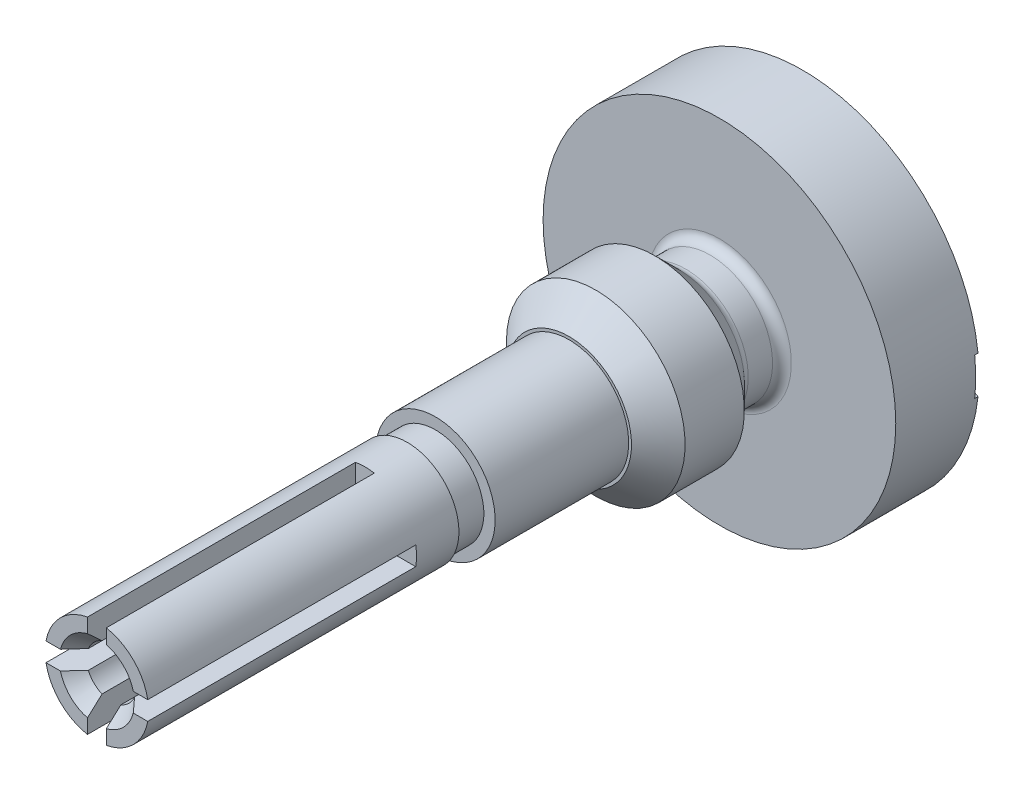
from build123d import *

# Parameters (mm, degrees)
HOLE1_D                 = 1.3462
HOLE1_DEPTH             = 7.62
HOLE1_CSINK_D           = 2.032
HOLE1_CSINK_ANGLE       = 82
CUT_EXTRUDE1_DEPTH      = 19.11353946
CUT_EXTRUDE1_DEPTH_BACK = 19.11353946
SKETCH6_W               = 0.941336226
SKETCH6_H               = 1.016
SKETCH7_W               = 7.239
SKETCH7_H               = 0.508
CUT_EXTRUDE2_DEPTH      = 19.113539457
CIRPATTERN1_COUNT       = 2
CIRPATTERN1_ANGLE       = 90


with BuildPart() as part:
    # Sketch1 → Revolve1 (revolve)
    with BuildSketch(Plane(origin=(0, 0, 0), x_dir=(0, 0, -1), z_dir=(1, 0, 0)), mode=Mode.PRIVATE) as revolve1_sk:
        with BuildLine():
            Line((0, 1.9431), (0, 4.7625))
            Line((0, 4.7625), (2.248215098, 4.7625))
            ThreePointArc((2.248215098, 4.7625), (2.941150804, 2.425919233), (3.175, 0))
            Line((3.175, 0), (-16.8148, 0))
            Line((-16.8148, 0), (-16.8148, 1.397))
            Line((-16.8148, 1.397), (-8.4328, 1.397))
            Line((-8.4328, 1.397), (-8.4328, 1.3081))
            Line((-8.4328, 1.3081), (-7.6708, 1.3081))
            Line((-7.6708, 1.3081), (-7.6708, 1.6129))
            Line((-7.6708, 1.6129), (-4.064, 1.6129))
            Line((-4.064, 1.6129), (-4.064, 1.6891))
            Line((-4.064, 1.6891), (-3.3401, 2.413))
            Line((-3.3401, 2.413), (-1.7399, 2.413))
            Line((-1.7399, 2.413), (-1.090394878, 1.763494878))
            ThreePointArc((-1.090394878, 1.763494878), (-1.007991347, 1.708434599), (-0.910789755, 1.6891))
            Line((-0.910789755, 1.6891), (-0.254, 1.6891))
            ThreePointArc((-0.254, 1.6891), (-0.074394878, 1.763494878), (0, 1.9431))
        make_face()
    revolve(revolve1_sk.sketch.rotate(Axis((0, 0, -8.463411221), (0, 0, 1)), 90), axis=Axis((0, 0, -8.463411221), (0, 0, 1)))

    # Hole1
    with Locations(Plane.XY.offset(16.8148)):
        with Locations((0, 0)):
            CounterSinkHole(HOLE1_D / 2, HOLE1_CSINK_D / 2, depth=HOLE1_DEPTH, counter_sink_angle=HOLE1_CSINK_ANGLE)

    # Sketch5 → Cut-Revolve1 (revolve, cut)
    with BuildSketch(Plane(origin=(0, 0, 0), x_dir=(0, 0, -1), z_dir=(1, 0, 0)), mode=Mode.PRIVATE) as cut_revolve1_sk:
        Polygon((3.175, 0), (3.175, -1.439998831), (2.921, -1.2192), (0.47214051, -0.7874), (-0.635, -0.7874), (-1.108117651, 0), align=None)
    revolve(cut_revolve1_sk.sketch.rotate(Axis((0, 0, -1.361196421), (0, 0, -1)), 270), axis=Axis((0, 0, -1.361196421), (0, 0, -1)), mode=Mode.SUBTRACT)

    # Sketch6 → Cut-Extrude1 (cut, two sides: drawn at the far end of the back side and taken through both)
    with BuildSketch(Plane(origin=(0, 0, 0), x_dir=(0, 0, -1), z_dir=(1, 0, 0)).offset(-CUT_EXTRUDE1_DEPTH_BACK)):
        with Locations((2.629668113, 0)):
            Rectangle(SKETCH6_W, SKETCH6_H)
    extrude(amount=CUT_EXTRUDE1_DEPTH + CUT_EXTRUDE1_DEPTH_BACK, mode=Mode.SUBTRACT)

    # Sketch7 → Cut-Extrude2 (cut, symmetric)
    with BuildSketch(Plane(origin=(0, 0, 0), x_dir=(0, 0, -1), z_dir=(1, 0, 0))):
        with Locations((-13.1953, 0)):
            Rectangle(SKETCH7_W, SKETCH7_H)
    cut_extrude2 = extrude(amount=CUT_EXTRUDE2_DEPTH, both=True, mode=Mode.SUBTRACT)

    # CirPattern1: Cut-Extrude2 ×2 about axis
    cirpattern1_axis = Axis((0, 0, 50), (0, 0, -1))
    for i in range(1, CIRPATTERN1_COUNT):
        add(cut_extrude2.rotate(cirpattern1_axis, i * CIRPATTERN1_ANGLE / (CIRPATTERN1_COUNT - 1)), mode=Mode.SUBTRACT)


solid = part.part
